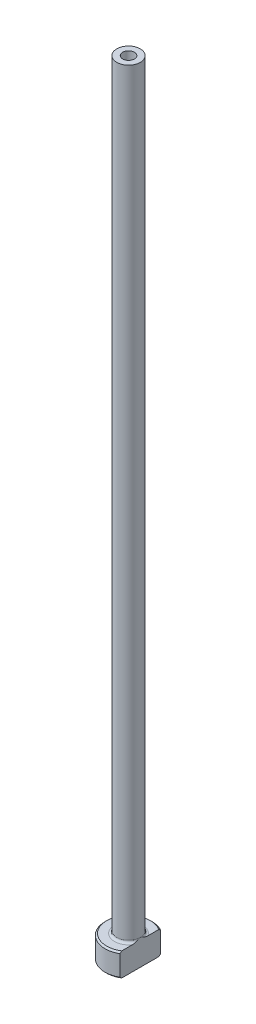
from build123d import *

# Parameters (mm, degrees)
FILLET1_R          = 0.3
CHAMFER1_SIZE      = 0.2
CUT_EXTRUDE1_DEPTH = 101.08995953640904
CHAMFER2_SIZE      = 0.5


with BuildPart() as part:
    # Sketch1 → Revolve1 (revolve)
    with BuildSketch(Plane.XY, mode=Mode.PRIVATE) as revolve1_sk:
        Polygon((-0.7500000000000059, 100), (-1.5000000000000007, 100), (-1.499999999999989, 3), (-2.999999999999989, 3), (-2.999999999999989, 0), (-0.99999999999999, 0), (-0.9999999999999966, 53.00000000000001), (-0.7500000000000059, 65), align=None)
    revolve(revolve1_sk.sketch.rotate(Axis((0, 92.18768090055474, 0), (0, -1, 0)), 270), axis=Axis((0, 92.18768090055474, 0), (0, -1, 0)))

    # Fillet1
    fillet1_edges = [part.edges().sort_by_distance(p)[0] for p in [
        (-5.2e-16, 3, -1.499999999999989),
    ]]
    fillet(fillet1_edges, radius=FILLET1_R)

    # Chamfer1
    chamfer1_edges = [part.edges().sort_by_distance(p)[0] for p in [
        (-1.03e-15, 0, -2.999999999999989),
        (-1.03e-15, 3, -2.999999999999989),
    ]]
    chamfer(chamfer1_edges, length=CHAMFER1_SIZE)

    # Sketch2 → Cut-Extrude1 (cut, through all)
    with BuildSketch(Plane.XZ):
        with BuildLine():
            Line((1.4999999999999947, 2.598076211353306), (1.4999999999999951, -2.598076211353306))
            ThreePointArc((1.4999999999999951, -2.598076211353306), (2.9999999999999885, 6.7e-16), (1.4999999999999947, 2.598076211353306))
        make_face()
    extrude(amount=-CUT_EXTRUDE1_DEPTH, mode=Mode.SUBTRACT)

    # Chamfer2
    chamfer2_edges = [part.edges().sort_by_distance(p)[0] for p in [
        (-3.4e-16, 0, -0.99999999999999),
    ]]
    chamfer(chamfer2_edges, length=CHAMFER2_SIZE)


solid = part.part
